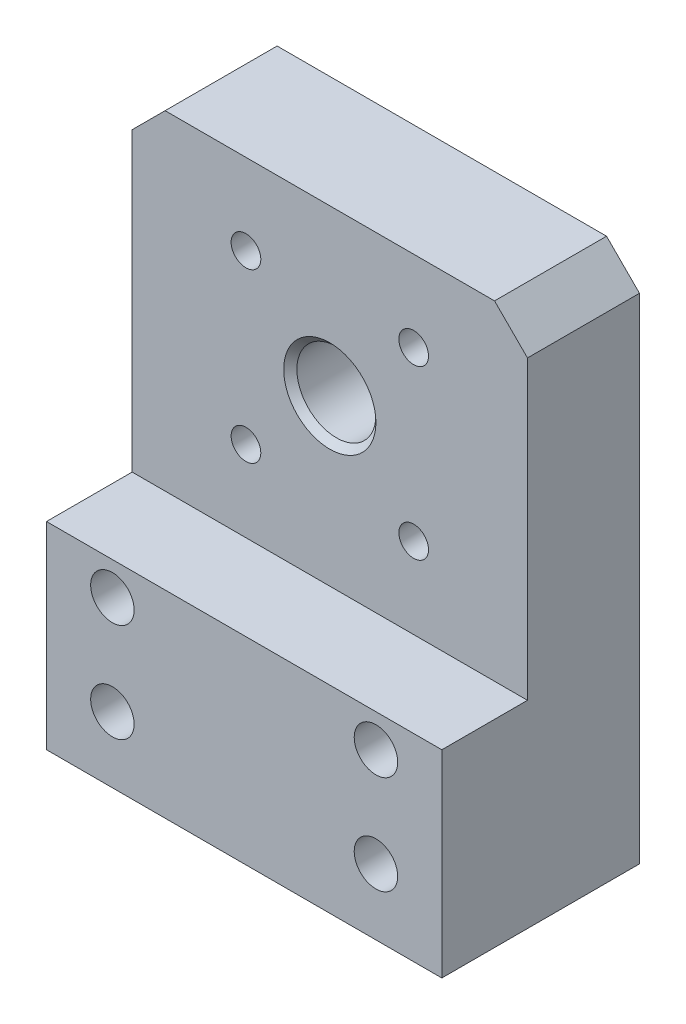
from build123d import *

# Parameters (mm, degrees)
ESQUISSE1_W                                        = 60
ESQUISSE1_H                                        = 50
ESQUISSE1_R                                        = 6
EXTRUSION2_DEPTH                                   = 8.5
ESQUISSE3_W                                        = 60
ESQUISSE3_H                                        = 30
EXTRUSION3_DEPTH                                   = 30
CHAMBRAGE_POUR_VIS_T_TE_HEXAGONALE_M61_D           = 6.6
CHAMBRAGE_POUR_VIS_T_TE_HEXAGONALE_M61_CBORE_D     = 11
CHAMBRAGE_POUR_VIS_T_TE_HEXAGONALE_M61_CBORE_DEPTH = 6
D_GAGEMENT_M41_D                                   = 4.5
ESQUISSE12_R                                       = 12.5
ENL_V_MAT_EXTRU_3_DEPTH                            = 3
ESQUISSE13_R                                       = 10
ENL_V_MAT_EXTRU_4_DEPTH                            = 1.5
CHANFREIN1_SIZE                                    = 1
CHANFREIN2_SIZE                                    = 5


with BuildPart() as part:
    # Esquisse1 → Extrusion2 (new, symmetric)
    with BuildSketch(Plane.XY):
        Rectangle(ESQUISSE1_W, ESQUISSE1_H)
        Circle(ESQUISSE1_R, mode=Mode.SUBTRACT)
    extrude(amount=EXTRUSION2_DEPTH, both=True)

    # Esquisse3 → Extrusion3 (add)
    with BuildSketch(Plane(origin=(0, 0, -8.5), x_dir=(-1, 0, 0), z_dir=(0, 0, -1))):
        with Locations((0, -40)):
            Rectangle(ESQUISSE3_W, ESQUISSE3_H)
    extrude(amount=-EXTRUSION3_DEPTH)

    # Chambrage pour vis _ t_te hexagonale M61 (through all)
    with Locations(Plane(origin=(0, 0, -8.5), x_dir=(-1, 0, 0), z_dir=(0, 0, -1))):
        with Locations((-20, -30), (20, -30), (20, -45), (-20, -45)):
            CounterBoreHole(CHAMBRAGE_POUR_VIS_T_TE_HEXAGONALE_M61_D / 2, CHAMBRAGE_POUR_VIS_T_TE_HEXAGONALE_M61_CBORE_D / 2, CHAMBRAGE_POUR_VIS_T_TE_HEXAGONALE_M61_CBORE_DEPTH)

    # D_gagement M41 (through all)
    with Locations(Plane(origin=(0, 0, -8.5), x_dir=(-1, 0, 0), z_dir=(0, 0, -1))):
        with Locations((12.727922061, -12.727922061), (-12.727922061, -12.727922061), (12.727922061, 12.727922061), (-12.727922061, 12.727922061)):
            Hole(D_GAGEMENT_M41_D / 2)

    # Esquisse12 → Enl_v. mat.-Extru.3 (cut)
    with BuildSketch(Plane(origin=(0, 0, -8.5), x_dir=(-1, 0, 0), z_dir=(0, 0, -1))):
        Circle(ESQUISSE12_R)
    extrude(amount=-ENL_V_MAT_EXTRU_3_DEPTH, mode=Mode.SUBTRACT)

    # Esquisse13 → Enl_v. mat.-Extru.4 (cut)
    with BuildSketch(Plane(origin=(0, 0, -5.5), x_dir=(-1, 0, 0), z_dir=(0, 0, -1))):
        Circle(ESQUISSE13_R)
    extrude(amount=-ENL_V_MAT_EXTRU_4_DEPTH, mode=Mode.SUBTRACT)

    # Chanfrein1
    chanfrein1_edges = [part.edges().sort_by_distance(p)[0] for p in [
        (-6, 0, 8.5),
        (-6, 0, -4),
    ]]
    chamfer(chanfrein1_edges, length=CHANFREIN1_SIZE)

    # Chanfrein2
    chanfrein2_edges = [part.edges().sort_by_distance(p)[0] for p in [
        (-30, 25, 0),
        (30, 25, 0),
    ]]
    chamfer(chanfrein2_edges, length=CHANFREIN2_SIZE)


solid = part.part
